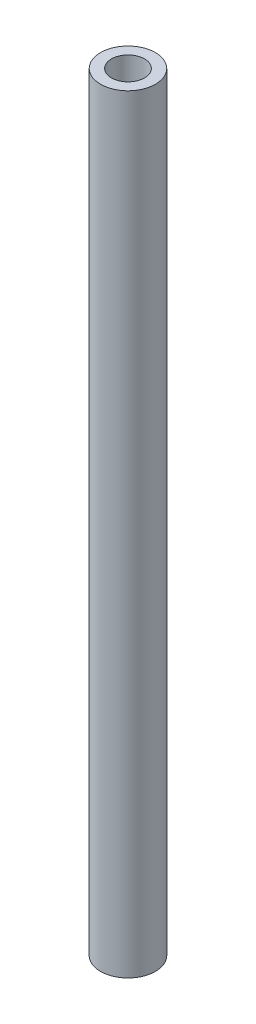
from build123d import *

# Parameters (mm, degrees)
SKETCH1_R           = 3.175
SKETCH1_R_2         = 1.912647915
BOSS_EXTRUDE1_DEPTH = 88.9


with BuildPart() as part:
    # Sketch1 → Boss-Extrude1 (new body)
    with BuildSketch(Plane(origin=(0, 0, 0), x_dir=(1, 0, 0), z_dir=(0, 1, 0))):
        with Locations(Location((0, 0, 0), (0, 0, 270))):
            Circle(SKETCH1_R)
        with Locations(Location((0, 0, 0), (0, 0, 270))):
            Circle(SKETCH1_R_2, mode=Mode.SUBTRACT)
    extrude(amount=BOSS_EXTRUDE1_DEPTH)


solid = part.part
